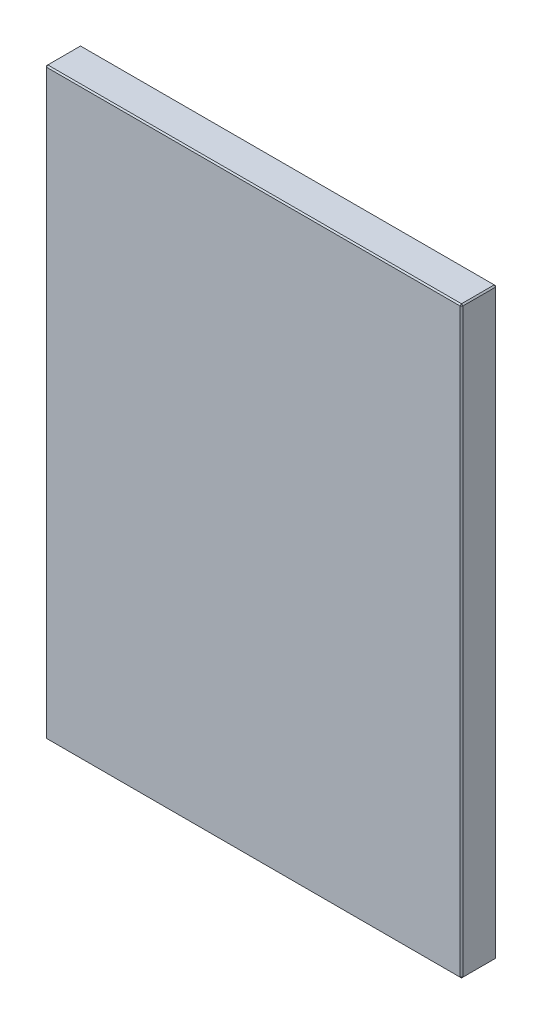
ISO-10303-21;
HEADER;
FILE_DESCRIPTION(('STEP AP214'),'2;1');
FILE_NAME('part.step','',(''),(''),'','','');
FILE_SCHEMA(('AUTOMOTIVE_DESIGN { 1 0 10303 214 1 1 1 1 }'));
ENDSEC;
DATA;
#1=APPLICATION_CONTEXT('core data for automotive mechanical design processes');
#2=APPLICATION_PROTOCOL_DEFINITION('international standard','automotive_design',2000,#1);
#3=PRODUCT_CONTEXT('',#1,'mechanical');
#4=PRODUCT('Part','Part','',(#3));
#5=PRODUCT_RELATED_PRODUCT_CATEGORY('part','',(#4));
#6=PRODUCT_DEFINITION_FORMATION('','',#4);
#7=PRODUCT_DEFINITION_CONTEXT('part definition',#1,'design');
#8=PRODUCT_DEFINITION('design','',#6,#7);
#9=PRODUCT_DEFINITION_SHAPE('','',#8);
#10=(LENGTH_UNIT() NAMED_UNIT(*) SI_UNIT(.MILLI.,.METRE.));
#11=(NAMED_UNIT(*) PLANE_ANGLE_UNIT() SI_UNIT($,.RADIAN.));
#12=(NAMED_UNIT(*) SI_UNIT($,.STERADIAN.) SOLID_ANGLE_UNIT());
#13=UNCERTAINTY_MEASURE_WITH_UNIT(LENGTH_MEASURE(1.E-05),#10,'distance_accuracy_value','');
#14=(GEOMETRIC_REPRESENTATION_CONTEXT(3) GLOBAL_UNCERTAINTY_ASSIGNED_CONTEXT((#13)) GLOBAL_UNIT_ASSIGNED_CONTEXT((#10,
#11,#12)) REPRESENTATION_CONTEXT('',''));
#15=CARTESIAN_POINT('',(0.,0.,0.));
#16=DIRECTION('',(0.,0.,1.));
#17=DIRECTION('',(1.,0.,0.));
#18=AXIS2_PLACEMENT_3D('',#15,#16,#17);
#19=CARTESIAN_POINT('',(-159.,-223.,27.));
#20=DIRECTION('',(1.,0.,0.));
#21=DIRECTION('',(0.,0.,-1.));
#22=AXIS2_PLACEMENT_3D('',#19,#20,#21);
#23=PLANE('',#22);
#24=DIRECTION('',(0.,0.,-1.));
#25=VECTOR('',#24,1.);
#26=CARTESIAN_POINT('',(-159.,222.,27.));
#27=LINE('',#26,#25);
#28=CARTESIAN_POINT('',(-159.,222.,26.));
#29=VERTEX_POINT('',#28);
#30=CARTESIAN_POINT('',(-159.,222.,1.));
#31=VERTEX_POINT('',#30);
#32=EDGE_CURVE('E114',#29,#31,#27,.T.);
#33=ORIENTED_EDGE('',*,*,#32,.T.);
#34=DIRECTION('',(0.,-1.,0.));
#35=VECTOR('',#34,1.);
#36=CARTESIAN_POINT('',(-159.,-223.,1.));
#37=LINE('',#36,#35);
#38=CARTESIAN_POINT('',(-159.,-222.,1.));
#39=VERTEX_POINT('',#38);
#40=EDGE_CURVE('E110',#31,#39,#37,.T.);
#41=ORIENTED_EDGE('',*,*,#40,.T.);
#42=DIRECTION('',(0.,0.,1.));
#43=VECTOR('',#42,1.);
#44=CARTESIAN_POINT('',(-159.,-222.,27.));
#45=LINE('',#44,#43);
#46=CARTESIAN_POINT('',(-159.,-222.,26.));
#47=VERTEX_POINT('',#46);
#48=EDGE_CURVE('E103',#39,#47,#45,.T.);
#49=ORIENTED_EDGE('',*,*,#48,.T.);
#50=DIRECTION('',(0.,1.,0.));
#51=VECTOR('',#50,1.);
#52=CARTESIAN_POINT('',(-159.,223.,26.));
#53=LINE('',#52,#51);
#54=EDGE_CURVE('E107',#47,#29,#53,.T.);
#55=ORIENTED_EDGE('',*,*,#54,.T.);
#56=EDGE_LOOP('',(#33,#41,#49,#55));
#57=FACE_BOUND('',#56,.T.);
#58=ADVANCED_FACE('F15',(#57),#23,.F.);
#59=CARTESIAN_POINT('',(159.,-223.,27.));
#60=DIRECTION('',(0.,1.,0.));
#61=DIRECTION('',(-1.,0.,0.));
#62=AXIS2_PLACEMENT_3D('',#59,#60,#61);
#63=PLANE('',#62);
#64=DIRECTION('',(0.,0.,-1.));
#65=VECTOR('',#64,1.);
#66=CARTESIAN_POINT('',(-158.,-223.,27.));
#67=LINE('',#66,#65);
#68=CARTESIAN_POINT('',(-158.,-223.,26.));
#69=VERTEX_POINT('',#68);
#70=CARTESIAN_POINT('',(-158.,-223.,1.));
#71=VERTEX_POINT('',#70);
#72=EDGE_CURVE('E122',#69,#71,#67,.T.);
#73=ORIENTED_EDGE('',*,*,#72,.T.);
#74=DIRECTION('',(1.,0.,0.));
#75=VECTOR('',#74,1.);
#76=CARTESIAN_POINT('',(159.,-223.,1.));
#77=LINE('',#76,#75);
#78=CARTESIAN_POINT('',(158.,-223.,1.));
#79=VERTEX_POINT('',#78);
#80=EDGE_CURVE('E160',#71,#79,#77,.T.);
#81=ORIENTED_EDGE('',*,*,#80,.T.);
#82=DIRECTION('',(0.,0.,1.));
#83=VECTOR('',#82,1.);
#84=CARTESIAN_POINT('',(158.,-223.,27.));
#85=LINE('',#84,#83);
#86=CARTESIAN_POINT('',(158.,-223.,26.));
#87=VERTEX_POINT('',#86);
#88=EDGE_CURVE('E157',#79,#87,#85,.T.);
#89=ORIENTED_EDGE('',*,*,#88,.T.);
#90=DIRECTION('',(-1.,0.,0.));
#91=VECTOR('',#90,1.);
#92=CARTESIAN_POINT('',(-159.,-223.,26.));
#93=LINE('',#92,#91);
#94=EDGE_CURVE('E155',#87,#69,#93,.T.);
#95=ORIENTED_EDGE('',*,*,#94,.T.);
#96=EDGE_LOOP('',(#73,#81,#89,#95));
#97=FACE_BOUND('',#96,.T.);
#98=ADVANCED_FACE('F277',(#97),#63,.F.);
#99=CARTESIAN_POINT('',(159.,-223.,27.));
#100=DIRECTION('',(-1.,0.,0.));
#101=DIRECTION('',(0.,0.,1.));
#102=AXIS2_PLACEMENT_3D('',#99,#100,#101);
#103=PLANE('',#102);
#104=DIRECTION('',(0.,-1.,0.));
#105=VECTOR('',#104,1.);
#106=CARTESIAN_POINT('',(159.,-223.,26.));
#107=LINE('',#106,#105);
#108=CARTESIAN_POINT('',(159.,222.,26.));
#109=VERTEX_POINT('',#108);
#110=CARTESIAN_POINT('',(159.,-222.,26.));
#111=VERTEX_POINT('',#110);
#112=EDGE_CURVE('E162',#109,#111,#107,.T.);
#113=ORIENTED_EDGE('',*,*,#112,.T.);
#114=DIRECTION('',(0.,0.,-1.));
#115=VECTOR('',#114,1.);
#116=CARTESIAN_POINT('',(159.,-222.,27.));
#117=LINE('',#116,#115);
#118=CARTESIAN_POINT('',(159.,-222.,1.));
#119=VERTEX_POINT('',#118);
#120=EDGE_CURVE('E168',#111,#119,#117,.T.);
#121=ORIENTED_EDGE('',*,*,#120,.T.);
#122=DIRECTION('',(0.,1.,0.));
#123=VECTOR('',#122,1.);
#124=CARTESIAN_POINT('',(159.,-223.,1.));
#125=LINE('',#124,#123);
#126=CARTESIAN_POINT('',(159.,222.,1.));
#127=VERTEX_POINT('',#126);
#128=EDGE_CURVE('E166',#119,#127,#125,.T.);
#129=ORIENTED_EDGE('',*,*,#128,.T.);
#130=DIRECTION('',(0.,0.,1.));
#131=VECTOR('',#130,1.);
#132=CARTESIAN_POINT('',(159.,222.,27.));
#133=LINE('',#132,#131);
#134=EDGE_CURVE('E164',#127,#109,#133,.T.);
#135=ORIENTED_EDGE('',*,*,#134,.T.);
#136=EDGE_LOOP('',(#113,#121,#129,#135));
#137=FACE_BOUND('',#136,.T.);
#138=ADVANCED_FACE('F254',(#137),#103,.F.);
#139=CARTESIAN_POINT('',(159.,223.,27.));
#140=DIRECTION('',(0.,-1.,0.));
#141=DIRECTION('',(1.,0.,0.));
#142=AXIS2_PLACEMENT_3D('',#139,#140,#141);
#143=PLANE('',#142);
#144=DIRECTION('',(-1.,0.,0.));
#145=VECTOR('',#144,1.);
#146=CARTESIAN_POINT('',(159.,223.,1.));
#147=LINE('',#146,#145);
#148=CARTESIAN_POINT('',(158.,223.,1.));
#149=VERTEX_POINT('',#148);
#150=CARTESIAN_POINT('',(-158.,223.,1.));
#151=VERTEX_POINT('',#150);
#152=EDGE_CURVE('E150',#149,#151,#147,.T.);
#153=ORIENTED_EDGE('',*,*,#152,.T.);
#154=DIRECTION('',(0.,0.,1.));
#155=VECTOR('',#154,1.);
#156=CARTESIAN_POINT('',(-158.,223.,27.));
#157=LINE('',#156,#155);
#158=CARTESIAN_POINT('',(-158.,223.,26.));
#159=VERTEX_POINT('',#158);
#160=EDGE_CURVE('E152',#151,#159,#157,.T.);
#161=ORIENTED_EDGE('',*,*,#160,.T.);
#162=DIRECTION('',(1.,0.,0.));
#163=VECTOR('',#162,1.);
#164=CARTESIAN_POINT('',(159.,223.,26.));
#165=LINE('',#164,#163);
#166=CARTESIAN_POINT('',(158.,223.,26.));
#167=VERTEX_POINT('',#166);
#168=EDGE_CURVE('E146',#159,#167,#165,.T.);
#169=ORIENTED_EDGE('',*,*,#168,.T.);
#170=DIRECTION('',(0.,0.,-1.));
#171=VECTOR('',#170,1.);
#172=CARTESIAN_POINT('',(158.,223.,27.));
#173=LINE('',#172,#171);
#174=EDGE_CURVE('E148',#167,#149,#173,.T.);
#175=ORIENTED_EDGE('',*,*,#174,.T.);
#176=EDGE_LOOP('',(#153,#161,#169,#175));
#177=FACE_BOUND('',#176,.T.);
#178=ADVANCED_FACE('F286',(#177),#143,.F.);
#179=CARTESIAN_POINT('',(0.,0.,27.));
#180=DIRECTION('',(0.,0.,1.));
#181=DIRECTION('',(1.,0.,0.));
#182=AXIS2_PLACEMENT_3D('',#179,#180,#181);
#183=PLANE('',#182);
#184=DIRECTION('',(0.,1.,0.));
#185=VECTOR('',#184,1.);
#186=CARTESIAN_POINT('',(158.,223.,27.));
#187=LINE('',#186,#185);
#188=CARTESIAN_POINT('',(158.,-222.,27.));
#189=VERTEX_POINT('',#188);
#190=CARTESIAN_POINT('',(158.,222.,27.));
#191=VERTEX_POINT('',#190);
#192=EDGE_CURVE('E24',#189,#191,#187,.T.);
#193=ORIENTED_EDGE('',*,*,#192,.T.);
#194=DIRECTION('',(-1.,0.,0.));
#195=VECTOR('',#194,1.);
#196=CARTESIAN_POINT('',(-159.,222.,27.));
#197=LINE('',#196,#195);
#198=CARTESIAN_POINT('',(-158.,222.,27.));
#199=VERTEX_POINT('',#198);
#200=EDGE_CURVE('E9',#191,#199,#197,.T.);
#201=ORIENTED_EDGE('',*,*,#200,.T.);
#202=DIRECTION('',(0.,-1.,0.));
#203=VECTOR('',#202,1.);
#204=CARTESIAN_POINT('',(-158.,-223.,27.));
#205=LINE('',#204,#203);
#206=CARTESIAN_POINT('',(-158.,-222.,27.));
#207=VERTEX_POINT('',#206);
#208=EDGE_CURVE('E180',#199,#207,#205,.T.);
#209=ORIENTED_EDGE('',*,*,#208,.T.);
#210=DIRECTION('',(1.,0.,0.));
#211=VECTOR('',#210,1.);
#212=CARTESIAN_POINT('',(159.,-222.,27.));
#213=LINE('',#212,#211);
#214=EDGE_CURVE('E35',#207,#189,#213,.T.);
#215=ORIENTED_EDGE('',*,*,#214,.T.);
#216=EDGE_LOOP('',(#193,#201,#209,#215));
#217=FACE_BOUND('',#216,.T.);
#218=ADVANCED_FACE('F351',(#217),#183,.T.);
#219=CARTESIAN_POINT('',(0.,0.,0.));
#220=DIRECTION('',(0.,0.,1.));
#221=DIRECTION('',(1.,0.,0.));
#222=AXIS2_PLACEMENT_3D('',#219,#220,#221);
#223=PLANE('',#222);
#224=DIRECTION('',(0.,-1.,0.));
#225=VECTOR('',#224,1.);
#226=CARTESIAN_POINT('',(158.,0.,0.));
#227=LINE('',#226,#225);
#228=CARTESIAN_POINT('',(158.,222.,0.));
#229=VERTEX_POINT('',#228);
#230=CARTESIAN_POINT('',(158.,-222.,0.));
#231=VERTEX_POINT('',#230);
#232=EDGE_CURVE('E175',#229,#231,#227,.T.);
#233=ORIENTED_EDGE('',*,*,#232,.T.);
#234=DIRECTION('',(-1.,0.,0.));
#235=VECTOR('',#234,1.);
#236=CARTESIAN_POINT('',(0.,-222.,0.));
#237=LINE('',#236,#235);
#238=CARTESIAN_POINT('',(-158.,-222.,0.));
#239=VERTEX_POINT('',#238);
#240=EDGE_CURVE('E177',#231,#239,#237,.T.);
#241=ORIENTED_EDGE('',*,*,#240,.T.);
#242=DIRECTION('',(0.,1.,0.));
#243=VECTOR('',#242,1.);
#244=CARTESIAN_POINT('',(-158.,0.,0.));
#245=LINE('',#244,#243);
#246=CARTESIAN_POINT('',(-158.,222.,0.));
#247=VERTEX_POINT('',#246);
#248=EDGE_CURVE('E173',#239,#247,#245,.T.);
#249=ORIENTED_EDGE('',*,*,#248,.T.);
#250=DIRECTION('',(1.,0.,0.));
#251=VECTOR('',#250,1.);
#252=CARTESIAN_POINT('',(0.,222.,0.));
#253=LINE('',#252,#251);
#254=EDGE_CURVE('E171',#247,#229,#253,.T.);
#255=ORIENTED_EDGE('',*,*,#254,.T.);
#256=EDGE_LOOP('',(#233,#241,#249,#255));
#257=FACE_BOUND('',#256,.T.);
#258=ADVANCED_FACE('F246',(#257),#223,.F.);
#259=CARTESIAN_POINT('',(159.,-222.,27.));
#260=DIRECTION('',(-0.707106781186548,0.707106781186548,0.));
#261=DIRECTION('',(0.,0.,-1.));
#262=AXIS2_PLACEMENT_3D('',#259,#260,#261);
#263=PLANE('',#262);
#264=DIRECTION('',(-0.707106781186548,-0.707106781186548,0.));
#265=VECTOR('',#264,1.);
#266=CARTESIAN_POINT('',(158.,-223.,26.));
#267=LINE('',#266,#265);
#268=EDGE_CURVE('E19',#87,#111,#267,.F.);
#269=ORIENTED_EDGE('',*,*,#268,.F.);
#270=ORIENTED_EDGE('',*,*,#88,.F.);
#271=DIRECTION('',(0.707106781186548,0.707106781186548,0.));
#272=VECTOR('',#271,1.);
#273=CARTESIAN_POINT('',(159.,-222.,1.));
#274=LINE('',#273,#272);
#275=EDGE_CURVE('E142',#119,#79,#274,.F.);
#276=ORIENTED_EDGE('',*,*,#275,.F.);
#277=ORIENTED_EDGE('',*,*,#120,.F.);
#278=EDGE_LOOP('',(#269,#270,#276,#277));
#279=FACE_BOUND('',#278,.T.);
#280=ADVANCED_FACE('F17',(#279),#263,.F.);
#281=CARTESIAN_POINT('',(158.,-223.,26.));
#282=DIRECTION('',(0.577350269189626,-0.577350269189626,0.577350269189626));
#283=DIRECTION('',(0.707106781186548,0.,-0.707106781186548));
#284=AXIS2_PLACEMENT_3D('',#281,#282,#283);
#285=PLANE('',#284);
#286=DIRECTION('',(0.,-0.707106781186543,-0.707106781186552));
#287=VECTOR('',#286,1.);
#288=CARTESIAN_POINT('',(158.,-223.,26.));
#289=LINE('',#288,#287);
#290=EDGE_CURVE('E227',#87,#189,#289,.F.);
#291=ORIENTED_EDGE('',*,*,#290,.F.);
#292=ORIENTED_EDGE('',*,*,#268,.T.);
#293=DIRECTION('',(-0.707106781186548,0.,0.707106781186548));
#294=VECTOR('',#293,1.);
#295=CARTESIAN_POINT('',(158.5,-222.,26.5));
#296=LINE('',#295,#294);
#297=EDGE_CURVE('E229',#189,#111,#296,.F.);
#298=ORIENTED_EDGE('',*,*,#297,.F.);
#299=EDGE_LOOP('',(#291,#292,#298));
#300=FACE_BOUND('',#299,.T.);
#301=ADVANCED_FACE('F272',(#300),#285,.T.);
#302=CARTESIAN_POINT('',(159.,-222.,1.));
#303=DIRECTION('',(0.577350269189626,-0.577350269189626,-0.577350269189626));
#304=DIRECTION('',(-0.707106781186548,0.,-0.707106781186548));
#305=AXIS2_PLACEMENT_3D('',#302,#303,#304);
#306=PLANE('',#305);
#307=DIRECTION('',(-0.707106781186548,0.,-0.707106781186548));
#308=VECTOR('',#307,1.);
#309=CARTESIAN_POINT('',(159.,-222.,1.));
#310=LINE('',#309,#308);
#311=EDGE_CURVE('E221',#119,#231,#310,.T.);
#312=ORIENTED_EDGE('',*,*,#311,.F.);
#313=ORIENTED_EDGE('',*,*,#275,.T.);
#314=DIRECTION('',(0.,-0.707106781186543,0.707106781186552));
#315=VECTOR('',#314,1.);
#316=CARTESIAN_POINT('',(158.,-222.5,0.500000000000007));
#317=LINE('',#316,#315);
#318=EDGE_CURVE('E224',#231,#79,#317,.T.);
#319=ORIENTED_EDGE('',*,*,#318,.F.);
#320=EDGE_LOOP('',(#312,#313,#319));
#321=FACE_BOUND('',#320,.T.);
#322=ADVANCED_FACE('F236',(#321),#306,.T.);
#323=CARTESIAN_POINT('',(158.,0.,27.));
#324=DIRECTION('',(0.707106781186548,0.,0.707106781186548));
#325=DIRECTION('',(0.,-1.,0.));
#326=AXIS2_PLACEMENT_3D('',#323,#324,#325);
#327=PLANE('',#326);
#328=ORIENTED_EDGE('',*,*,#297,.T.);
#329=ORIENTED_EDGE('',*,*,#112,.F.);
#330=DIRECTION('',(0.707106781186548,0.,-0.707106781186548));
#331=VECTOR('',#330,1.);
#332=CARTESIAN_POINT('',(159.,222.,26.));
#333=LINE('',#332,#331);
#334=EDGE_CURVE('E215',#191,#109,#333,.T.);
#335=ORIENTED_EDGE('',*,*,#334,.F.);
#336=ORIENTED_EDGE('',*,*,#192,.F.);
#337=EDGE_LOOP('',(#328,#329,#335,#336));
#338=FACE_BOUND('',#337,.T.);
#339=ADVANCED_FACE('F267',(#338),#327,.T.);
#340=CARTESIAN_POINT('',(0.,-222.,27.));
#341=DIRECTION('',(0.,-0.707106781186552,0.707106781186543));
#342=DIRECTION('',(-1.,0.,0.));
#343=AXIS2_PLACEMENT_3D('',#340,#341,#342);
#344=PLANE('',#343);
#345=ORIENTED_EDGE('',*,*,#290,.T.);
#346=ORIENTED_EDGE('',*,*,#214,.F.);
#347=DIRECTION('',(0.,0.707106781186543,0.707106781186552));
#348=VECTOR('',#347,1.);
#349=CARTESIAN_POINT('',(-158.,-222.5,26.5));
#350=LINE('',#349,#348);
#351=EDGE_CURVE('E126',#69,#207,#350,.T.);
#352=ORIENTED_EDGE('',*,*,#351,.F.);
#353=ORIENTED_EDGE('',*,*,#94,.F.);
#354=EDGE_LOOP('',(#345,#346,#352,#353));
#355=FACE_BOUND('',#354,.T.);
#356=ADVANCED_FACE('F275',(#355),#344,.T.);
#357=CARTESIAN_POINT('',(-158.,-223.,27.));
#358=DIRECTION('',(0.707106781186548,0.707106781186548,0.));
#359=DIRECTION('',(0.,0.,-1.));
#360=AXIS2_PLACEMENT_3D('',#357,#358,#359);
#361=PLANE('',#360);
#362=DIRECTION('',(0.707106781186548,-0.707106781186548,0.));
#363=VECTOR('',#362,1.);
#364=CARTESIAN_POINT('',(-158.,-223.,1.));
#365=LINE('',#364,#363);
#366=EDGE_CURVE('E127',#71,#39,#365,.F.);
#367=ORIENTED_EDGE('',*,*,#366,.F.);
#368=ORIENTED_EDGE('',*,*,#72,.F.);
#369=DIRECTION('',(-0.707106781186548,0.707106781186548,0.));
#370=VECTOR('',#369,1.);
#371=CARTESIAN_POINT('',(-159.,-222.,26.));
#372=LINE('',#371,#370);
#373=EDGE_CURVE('E118',#47,#69,#372,.F.);
#374=ORIENTED_EDGE('',*,*,#373,.F.);
#375=ORIENTED_EDGE('',*,*,#48,.F.);
#376=EDGE_LOOP('',(#367,#368,#374,#375));
#377=FACE_BOUND('',#376,.T.);
#378=ADVANCED_FACE('F120',(#377),#361,.F.);
#379=CARTESIAN_POINT('',(159.,-223.,1.));
#380=DIRECTION('',(0.,0.707106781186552,0.707106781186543));
#381=DIRECTION('',(1.,0.,0.));
#382=AXIS2_PLACEMENT_3D('',#379,#380,#381);
#383=PLANE('',#382);
#384=ORIENTED_EDGE('',*,*,#318,.T.);
#385=ORIENTED_EDGE('',*,*,#80,.F.);
#386=DIRECTION('',(0.,0.707106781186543,-0.707106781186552));
#387=VECTOR('',#386,1.);
#388=CARTESIAN_POINT('',(-158.,-223.,1.));
#389=LINE('',#388,#387);
#390=EDGE_CURVE('E211',#239,#71,#389,.F.);
#391=ORIENTED_EDGE('',*,*,#390,.F.);
#392=ORIENTED_EDGE('',*,*,#240,.F.);
#393=EDGE_LOOP('',(#384,#385,#391,#392));
#394=FACE_BOUND('',#393,.T.);
#395=ADVANCED_FACE('F243',(#394),#383,.F.);
#396=CARTESIAN_POINT('',(159.,-223.,1.));
#397=DIRECTION('',(-0.707106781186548,0.,0.707106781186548));
#398=DIRECTION('',(0.,1.,0.));
#399=AXIS2_PLACEMENT_3D('',#396,#397,#398);
#400=PLANE('',#399);
#401=ORIENTED_EDGE('',*,*,#311,.T.);
#402=ORIENTED_EDGE('',*,*,#232,.F.);
#403=DIRECTION('',(0.707106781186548,0.,0.707106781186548));
#404=VECTOR('',#403,1.);
#405=CARTESIAN_POINT('',(159.,222.,1.));
#406=LINE('',#405,#404);
#407=EDGE_CURVE('E208',#127,#229,#406,.F.);
#408=ORIENTED_EDGE('',*,*,#407,.F.);
#409=ORIENTED_EDGE('',*,*,#128,.F.);
#410=EDGE_LOOP('',(#401,#402,#408,#409));
#411=FACE_BOUND('',#410,.T.);
#412=ADVANCED_FACE('F251',(#411),#400,.F.);
#413=CARTESIAN_POINT('',(158.,223.,27.));
#414=DIRECTION('',(-0.707106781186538,-0.707106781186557,0.));
#415=DIRECTION('',(0.,0.,-1.));
#416=AXIS2_PLACEMENT_3D('',#413,#414,#415);
#417=PLANE('',#416);
#418=DIRECTION('',(0.707106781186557,-0.707106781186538,0.));
#419=VECTOR('',#418,1.);
#420=CARTESIAN_POINT('',(159.,222.,26.));
#421=LINE('',#420,#419);
#422=EDGE_CURVE('E218',#109,#167,#421,.F.);
#423=ORIENTED_EDGE('',*,*,#422,.F.);
#424=ORIENTED_EDGE('',*,*,#134,.F.);
#425=DIRECTION('',(-0.707106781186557,0.707106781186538,0.));
#426=VECTOR('',#425,1.);
#427=CARTESIAN_POINT('',(159.,222.,1.));
#428=LINE('',#427,#426);
#429=EDGE_CURVE('E205',#149,#127,#428,.F.);
#430=ORIENTED_EDGE('',*,*,#429,.F.);
#431=ORIENTED_EDGE('',*,*,#174,.F.);
#432=EDGE_LOOP('',(#423,#424,#430,#431));
#433=FACE_BOUND('',#432,.T.);
#434=ADVANCED_FACE('F259',(#433),#417,.F.);
#435=CARTESIAN_POINT('',(159.,222.,26.));
#436=DIRECTION('',(0.577350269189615,0.577350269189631,0.577350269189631));
#437=DIRECTION('',(0.,-0.707106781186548,0.707106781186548));
#438=AXIS2_PLACEMENT_3D('',#435,#436,#437);
#439=PLANE('',#438);
#440=ORIENTED_EDGE('',*,*,#334,.T.);
#441=ORIENTED_EDGE('',*,*,#422,.T.);
#442=DIRECTION('',(0.,-0.707106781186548,0.707106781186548));
#443=VECTOR('',#442,1.);
#444=CARTESIAN_POINT('',(158.,222.5,26.5));
#445=LINE('',#444,#443);
#446=EDGE_CURVE('E134',#191,#167,#445,.F.);
#447=ORIENTED_EDGE('',*,*,#446,.F.);
#448=EDGE_LOOP('',(#440,#441,#447));
#449=FACE_BOUND('',#448,.T.);
#450=ADVANCED_FACE('F264',(#449),#439,.T.);
#451=CARTESIAN_POINT('',(-159.,-222.,26.));
#452=DIRECTION('',(-0.577350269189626,-0.577350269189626,0.577350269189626));
#453=DIRECTION('',(0.707106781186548,0.,0.707106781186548));
#454=AXIS2_PLACEMENT_3D('',#451,#452,#453);
#455=PLANE('',#454);
#456=ORIENTED_EDGE('',*,*,#373,.T.);
#457=ORIENTED_EDGE('',*,*,#351,.T.);
#458=DIRECTION('',(-0.707106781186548,0.,-0.707106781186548));
#459=VECTOR('',#458,1.);
#460=CARTESIAN_POINT('',(-159.,-222.,26.));
#461=LINE('',#460,#459);
#462=EDGE_CURVE('E130',#47,#207,#461,.F.);
#463=ORIENTED_EDGE('',*,*,#462,.F.);
#464=EDGE_LOOP('',(#456,#457,#463));
#465=FACE_BOUND('',#464,.T.);
#466=ADVANCED_FACE('F131',(#465),#455,.T.);
#467=CARTESIAN_POINT('',(-158.,-223.,1.));
#468=DIRECTION('',(-0.577350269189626,-0.577350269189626,-0.577350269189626));
#469=DIRECTION('',(-0.707106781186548,0.,0.707106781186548));
#470=AXIS2_PLACEMENT_3D('',#467,#468,#469);
#471=PLANE('',#470);
#472=ORIENTED_EDGE('',*,*,#390,.T.);
#473=ORIENTED_EDGE('',*,*,#366,.T.);
#474=DIRECTION('',(-0.707106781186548,0.,0.707106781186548));
#475=VECTOR('',#474,1.);
#476=CARTESIAN_POINT('',(-158.5,-222.,0.5));
#477=LINE('',#476,#475);
#478=EDGE_CURVE('E135',#239,#39,#477,.T.);
#479=ORIENTED_EDGE('',*,*,#478,.F.);
#480=EDGE_LOOP('',(#472,#473,#479));
#481=FACE_BOUND('',#480,.T.);
#482=ADVANCED_FACE('F320',(#481),#471,.T.);
#483=CARTESIAN_POINT('',(159.,222.,1.));
#484=DIRECTION('',(0.577350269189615,0.577350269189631,-0.577350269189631));
#485=DIRECTION('',(0.,0.707106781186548,0.707106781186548));
#486=AXIS2_PLACEMENT_3D('',#483,#484,#485);
#487=PLANE('',#486);
#488=ORIENTED_EDGE('',*,*,#429,.T.);
#489=ORIENTED_EDGE('',*,*,#407,.T.);
#490=DIRECTION('',(0.,-0.707106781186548,-0.707106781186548));
#491=VECTOR('',#490,1.);
#492=CARTESIAN_POINT('',(158.,222.5,0.500000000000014));
#493=LINE('',#492,#491);
#494=EDGE_CURVE('E198',#149,#229,#493,.T.);
#495=ORIENTED_EDGE('',*,*,#494,.F.);
#496=EDGE_LOOP('',(#488,#489,#495));
#497=FACE_BOUND('',#496,.T.);
#498=ADVANCED_FACE('F316',(#497),#487,.T.);
#499=CARTESIAN_POINT('',(0.,222.,27.));
#500=DIRECTION('',(0.,0.707106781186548,0.707106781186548));
#501=DIRECTION('',(1.,0.,0.));
#502=AXIS2_PLACEMENT_3D('',#499,#500,#501);
#503=PLANE('',#502);
#504=ORIENTED_EDGE('',*,*,#446,.T.);
#505=ORIENTED_EDGE('',*,*,#168,.F.);
#506=DIRECTION('',(0.,0.707106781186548,-0.707106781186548));
#507=VECTOR('',#506,1.);
#508=CARTESIAN_POINT('',(-158.,223.,26.));
#509=LINE('',#508,#507);
#510=EDGE_CURVE('E195',#199,#159,#509,.T.);
#511=ORIENTED_EDGE('',*,*,#510,.F.);
#512=ORIENTED_EDGE('',*,*,#200,.F.);
#513=EDGE_LOOP('',(#504,#505,#511,#512));
#514=FACE_BOUND('',#513,.T.);
#515=ADVANCED_FACE('F313',(#514),#503,.T.);
#516=CARTESIAN_POINT('',(-158.,0.,27.));
#517=DIRECTION('',(-0.707106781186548,0.,0.707106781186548));
#518=DIRECTION('',(0.,1.,0.));
#519=AXIS2_PLACEMENT_3D('',#516,#517,#518);
#520=PLANE('',#519);
#521=ORIENTED_EDGE('',*,*,#462,.T.);
#522=ORIENTED_EDGE('',*,*,#208,.F.);
#523=DIRECTION('',(0.707106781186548,0.,0.707106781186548));
#524=VECTOR('',#523,1.);
#525=CARTESIAN_POINT('',(-158.5,222.,26.5));
#526=LINE('',#525,#524);
#527=EDGE_CURVE('E138',#29,#199,#526,.T.);
#528=ORIENTED_EDGE('',*,*,#527,.F.);
#529=ORIENTED_EDGE('',*,*,#54,.F.);
#530=EDGE_LOOP('',(#521,#522,#528,#529));
#531=FACE_BOUND('',#530,.T.);
#532=ADVANCED_FACE('F137',(#531),#520,.T.);
#533=CARTESIAN_POINT('',(-159.,-223.,1.));
#534=DIRECTION('',(0.707106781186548,0.,0.707106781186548));
#535=DIRECTION('',(0.,-1.,0.));
#536=AXIS2_PLACEMENT_3D('',#533,#534,#535);
#537=PLANE('',#536);
#538=ORIENTED_EDGE('',*,*,#478,.T.);
#539=ORIENTED_EDGE('',*,*,#40,.F.);
#540=DIRECTION('',(0.707106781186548,0.,-0.707106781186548));
#541=VECTOR('',#540,1.);
#542=CARTESIAN_POINT('',(-159.,222.,1.));
#543=LINE('',#542,#541);
#544=EDGE_CURVE('E191',#247,#31,#543,.F.);
#545=ORIENTED_EDGE('',*,*,#544,.F.);
#546=ORIENTED_EDGE('',*,*,#248,.F.);
#547=EDGE_LOOP('',(#538,#539,#545,#546));
#548=FACE_BOUND('',#547,.T.);
#549=ADVANCED_FACE('F306',(#548),#537,.F.);
#550=CARTESIAN_POINT('',(159.,223.,1.));
#551=DIRECTION('',(0.,-0.707106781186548,0.707106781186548));
#552=DIRECTION('',(-1.,0.,0.));
#553=AXIS2_PLACEMENT_3D('',#550,#551,#552);
#554=PLANE('',#553);
#555=ORIENTED_EDGE('',*,*,#494,.T.);
#556=ORIENTED_EDGE('',*,*,#254,.F.);
#557=DIRECTION('',(0.,0.707106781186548,0.707106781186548));
#558=VECTOR('',#557,1.);
#559=CARTESIAN_POINT('',(-158.,222.5,0.5));
#560=LINE('',#559,#558);
#561=EDGE_CURVE('E188',#151,#247,#560,.F.);
#562=ORIENTED_EDGE('',*,*,#561,.F.);
#563=ORIENTED_EDGE('',*,*,#152,.F.);
#564=EDGE_LOOP('',(#555,#556,#562,#563));
#565=FACE_BOUND('',#564,.T.);
#566=ADVANCED_FACE('F302',(#565),#554,.F.);
#567=CARTESIAN_POINT('',(-158.,223.,26.));
#568=DIRECTION('',(-0.577350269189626,0.577350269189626,0.577350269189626));
#569=DIRECTION('',(0.707106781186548,0.,0.707106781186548));
#570=AXIS2_PLACEMENT_3D('',#567,#568,#569);
#571=PLANE('',#570);
#572=ORIENTED_EDGE('',*,*,#527,.T.);
#573=ORIENTED_EDGE('',*,*,#510,.T.);
#574=DIRECTION('',(0.707106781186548,0.707106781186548,0.));
#575=VECTOR('',#574,1.);
#576=CARTESIAN_POINT('',(-158.,223.,26.));
#577=LINE('',#576,#575);
#578=EDGE_CURVE('E186',#29,#159,#577,.T.);
#579=ORIENTED_EDGE('',*,*,#578,.F.);
#580=EDGE_LOOP('',(#572,#573,#579));
#581=FACE_BOUND('',#580,.T.);
#582=ADVANCED_FACE('F298',(#581),#571,.T.);
#583=CARTESIAN_POINT('',(-159.,222.,1.));
#584=DIRECTION('',(-0.577350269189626,0.577350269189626,-0.577350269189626));
#585=DIRECTION('',(-0.707106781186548,0.,0.707106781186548));
#586=AXIS2_PLACEMENT_3D('',#583,#584,#585);
#587=PLANE('',#586);
#588=ORIENTED_EDGE('',*,*,#561,.T.);
#589=ORIENTED_EDGE('',*,*,#544,.T.);
#590=DIRECTION('',(-0.707106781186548,-0.707106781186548,0.));
#591=VECTOR('',#590,1.);
#592=CARTESIAN_POINT('',(-159.,222.,1.));
#593=LINE('',#592,#591);
#594=EDGE_CURVE('E184',#151,#31,#593,.T.);
#595=ORIENTED_EDGE('',*,*,#594,.F.);
#596=EDGE_LOOP('',(#588,#589,#595));
#597=FACE_BOUND('',#596,.T.);
#598=ADVANCED_FACE('F294',(#597),#587,.T.);
#599=CARTESIAN_POINT('',(-159.,222.,27.));
#600=DIRECTION('',(0.707106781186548,-0.707106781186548,0.));
#601=DIRECTION('',(0.,0.,-1.));
#602=AXIS2_PLACEMENT_3D('',#599,#600,#601);
#603=PLANE('',#602);
#604=ORIENTED_EDGE('',*,*,#578,.T.);
#605=ORIENTED_EDGE('',*,*,#160,.F.);
#606=ORIENTED_EDGE('',*,*,#594,.T.);
#607=ORIENTED_EDGE('',*,*,#32,.F.);
#608=EDGE_LOOP('',(#604,#605,#606,#607));
#609=FACE_BOUND('',#608,.T.);
#610=ADVANCED_FACE('F291',(#609),#603,.F.);
#611=CLOSED_SHELL('',(#58,#98,#138,#178,#218,#258,#280,#301,#322,#339,#356,#378,#395,#412,#434,
#450,#466,#482,#498,#515,#532,#549,#566,#582,#598,#610));
#612=MANIFOLD_SOLID_BREP('B1',#611);
#613=ADVANCED_BREP_SHAPE_REPRESENTATION('',(#18,#612),#14);
#614=SHAPE_DEFINITION_REPRESENTATION(#9,#613);
ENDSEC;
END-ISO-10303-21;
